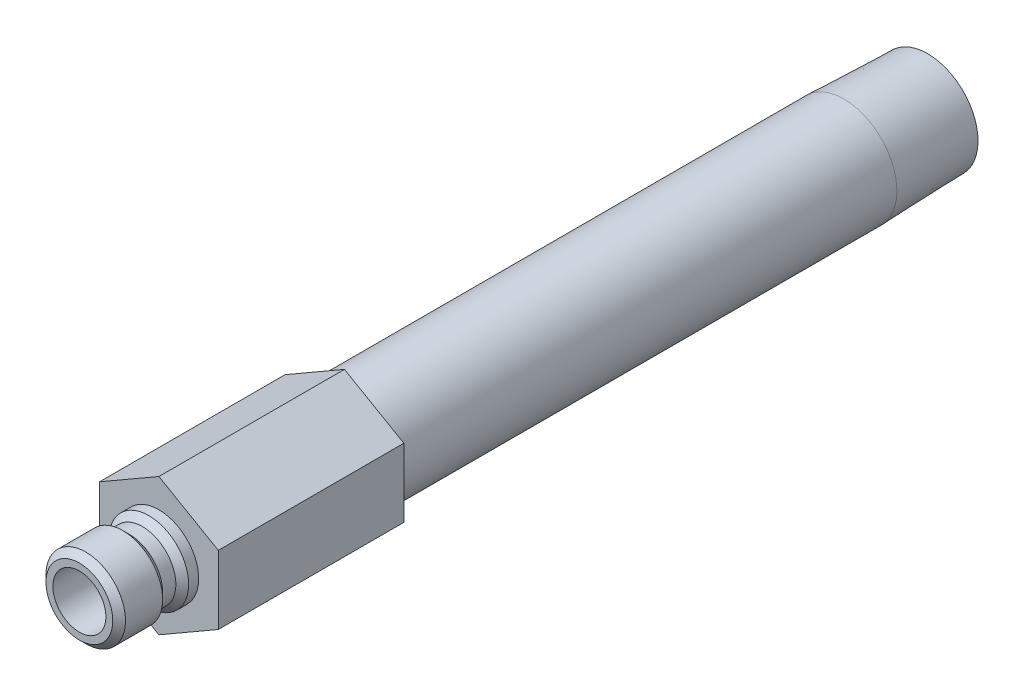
ISO-10303-21;
HEADER;
FILE_DESCRIPTION(('STEP AP214'),'2;1');
FILE_NAME('part.step','',(''),(''),'','','');
FILE_SCHEMA(('AUTOMOTIVE_DESIGN { 1 0 10303 214 1 1 1 1 }'));
ENDSEC;
DATA;
#1=APPLICATION_CONTEXT('core data for automotive mechanical design processes');
#2=APPLICATION_PROTOCOL_DEFINITION('international standard','automotive_design',2000,#1);
#3=PRODUCT_CONTEXT('',#1,'mechanical');
#4=PRODUCT('Part','Part','',(#3));
#5=PRODUCT_RELATED_PRODUCT_CATEGORY('part','',(#4));
#6=PRODUCT_DEFINITION_FORMATION('','',#4);
#7=PRODUCT_DEFINITION_CONTEXT('part definition',#1,'design');
#8=PRODUCT_DEFINITION('design','',#6,#7);
#9=PRODUCT_DEFINITION_SHAPE('','',#8);
#10=(LENGTH_UNIT() NAMED_UNIT(*) SI_UNIT(.MILLI.,.METRE.));
#11=(NAMED_UNIT(*) PLANE_ANGLE_UNIT() SI_UNIT($,.RADIAN.));
#12=(NAMED_UNIT(*) SI_UNIT($,.STERADIAN.) SOLID_ANGLE_UNIT());
#13=UNCERTAINTY_MEASURE_WITH_UNIT(LENGTH_MEASURE(1.E-05),#10,'distance_accuracy_value','');
#14=(GEOMETRIC_REPRESENTATION_CONTEXT(3) GLOBAL_UNCERTAINTY_ASSIGNED_CONTEXT((#13)) GLOBAL_UNIT_ASSIGNED_CONTEXT((#10,
#11,#12)) REPRESENTATION_CONTEXT('',''));
#15=CARTESIAN_POINT('',(0.,0.,0.));
#16=DIRECTION('',(0.,0.,1.));
#17=DIRECTION('',(1.,0.,0.));
#18=AXIS2_PLACEMENT_3D('',#15,#16,#17);
#19=CARTESIAN_POINT('',(0.,0.,0.));
#20=DIRECTION('',(0.,0.,-1.));
#21=DIRECTION('',(0.,1.,0.));
#22=AXIS2_PLACEMENT_3D('',#19,#20,#21);
#23=CYLINDRICAL_SURFACE('',#22,6.34999999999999);
#24=CARTESIAN_POINT('',(0.,0.,-82.042));
#25=DIRECTION('',(0.,0.,-1.));
#26=DIRECTION('',(0.,1.,0.));
#27=AXIS2_PLACEMENT_3D('',#24,#25,#26);
#28=CIRCLE('',#27,6.34999999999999);
#29=CARTESIAN_POINT('',(0.,6.35,-82.042));
#30=VERTEX_POINT('',#29);
#31=EDGE_CURVE('E42',#30,#30,#28,.T.);
#32=ORIENTED_EDGE('',*,*,#31,.F.);
#33=EDGE_LOOP('',(#32));
#34=FACE_BOUND('',#33,.T.);
#35=CARTESIAN_POINT('',(0.,0.,-22.225));
#36=DIRECTION('',(0.,0.,1.));
#37=DIRECTION('',(1.,0.,0.));
#38=AXIS2_PLACEMENT_3D('',#35,#36,#37);
#39=CIRCLE('',#38,6.34999999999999);
#40=CARTESIAN_POINT('',(6.34999999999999,0.,-22.225));
#41=VERTEX_POINT('',#40);
#42=EDGE_CURVE('E138',#41,#41,#39,.F.);
#43=ORIENTED_EDGE('',*,*,#42,.T.);
#44=EDGE_LOOP('',(#43));
#45=FACE_BOUND('',#44,.T.);
#46=ADVANCED_FACE('F33',(#34,#45),#23,.T.);
#47=CARTESIAN_POINT('',(0.,6.03647060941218,-92.075));
#48=DIRECTION('',(0.,0.,-1.));
#49=DIRECTION('',(0.,1.,0.));
#50=AXIS2_PLACEMENT_3D('',#47,#48,#49);
#51=PLANE('',#50);
#52=CARTESIAN_POINT('',(0.,0.,-92.075));
#53=DIRECTION('',(0.,0.,-1.));
#54=DIRECTION('',(0.,1.,0.));
#55=AXIS2_PLACEMENT_3D('',#52,#53,#54);
#56=CIRCLE('',#55,6.03647060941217);
#57=CARTESIAN_POINT('',(0.,6.03647060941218,-92.075));
#58=VERTEX_POINT('',#57);
#59=EDGE_CURVE('E11',#58,#58,#56,.T.);
#60=ORIENTED_EDGE('',*,*,#59,.T.);
#61=EDGE_LOOP('',(#60));
#62=FACE_BOUND('',#61,.T.);
#63=CARTESIAN_POINT('',(0.,0.,-92.075));
#64=DIRECTION('',(0.,0.,-1.));
#65=DIRECTION('',(0.,1.,0.));
#66=AXIS2_PLACEMENT_3D('',#63,#64,#65);
#67=CIRCLE('',#66,4.62279999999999);
#68=CARTESIAN_POINT('',(0.,4.6228,-92.075));
#69=VERTEX_POINT('',#68);
#70=EDGE_CURVE('E146',#69,#69,#67,.T.);
#71=ORIENTED_EDGE('',*,*,#70,.F.);
#72=EDGE_LOOP('',(#71));
#73=FACE_BOUND('',#72,.T.);
#74=ADVANCED_FACE('F35',(#62,#73),#51,.T.);
#75=CARTESIAN_POINT('',(0.,0.,-92.075));
#76=DIRECTION('',(0.,0.,1.));
#77=DIRECTION('',(0.,-1.,0.));
#78=AXIS2_PLACEMENT_3D('',#75,#76,#77);
#79=CONICAL_SURFACE('',#78,6.03647060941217,0.0312396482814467);
#80=ORIENTED_EDGE('',*,*,#31,.T.);
#81=EDGE_LOOP('',(#80));
#82=FACE_BOUND('',#81,.T.);
#83=ORIENTED_EDGE('',*,*,#59,.F.);
#84=EDGE_LOOP('',(#83));
#85=FACE_BOUND('',#84,.T.);
#86=ADVANCED_FACE('F181',(#82,#85),#79,.T.);
#87=CARTESIAN_POINT('',(0.,4.7625,0.));
#88=DIRECTION('',(0.,0.,1.));
#89=DIRECTION('',(0.,-1.,0.));
#90=AXIS2_PLACEMENT_3D('',#87,#88,#89);
#91=PLANE('',#90);
#92=CARTESIAN_POINT('',(0.,0.,0.));
#93=DIRECTION('',(0.,0.,-1.));
#94=DIRECTION('',(0.,1.,0.));
#95=AXIS2_PLACEMENT_3D('',#92,#93,#94);
#96=CIRCLE('',#95,4.7625);
#97=CARTESIAN_POINT('',(0.,4.7625,0.));
#98=VERTEX_POINT('',#97);
#99=EDGE_CURVE('E176',#98,#98,#96,.T.);
#100=ORIENTED_EDGE('',*,*,#99,.T.);
#101=EDGE_LOOP('',(#100));
#102=FACE_BOUND('',#101,.T.);
#103=DIRECTION('',(-0.866025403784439,-0.5,0.));
#104=VECTOR('',#103,1.);
#105=CARTESIAN_POINT('',(0.,8.21223022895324,0.));
#106=LINE('',#105,#104);
#107=CARTESIAN_POINT('',(0.,8.21223022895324,0.));
#108=VERTEX_POINT('',#107);
#109=CARTESIAN_POINT('',(-7.112,4.10611511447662,0.));
#110=VERTEX_POINT('',#109);
#111=EDGE_CURVE('E121',#108,#110,#106,.T.);
#112=ORIENTED_EDGE('',*,*,#111,.T.);
#113=DIRECTION('',(0.,-1.,0.));
#114=VECTOR('',#113,1.);
#115=CARTESIAN_POINT('',(-7.112,4.10611511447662,0.));
#116=LINE('',#115,#114);
#117=CARTESIAN_POINT('',(-7.112,-4.10611511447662,0.));
#118=VERTEX_POINT('',#117);
#119=EDGE_CURVE('E124',#110,#118,#116,.T.);
#120=ORIENTED_EDGE('',*,*,#119,.T.);
#121=DIRECTION('',(0.866025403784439,-0.5,0.));
#122=VECTOR('',#121,1.);
#123=CARTESIAN_POINT('',(-7.112,-4.10611511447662,0.));
#124=LINE('',#123,#122);
#125=CARTESIAN_POINT('',(0.,-8.21223022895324,0.));
#126=VERTEX_POINT('',#125);
#127=EDGE_CURVE('E127',#118,#126,#124,.T.);
#128=ORIENTED_EDGE('',*,*,#127,.T.);
#129=DIRECTION('',(0.866025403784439,0.5,0.));
#130=VECTOR('',#129,1.);
#131=CARTESIAN_POINT('',(0.,-8.21223022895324,0.));
#132=LINE('',#131,#130);
#133=CARTESIAN_POINT('',(7.112,-4.10611511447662,0.));
#134=VERTEX_POINT('',#133);
#135=EDGE_CURVE('E130',#126,#134,#132,.T.);
#136=ORIENTED_EDGE('',*,*,#135,.T.);
#137=DIRECTION('',(0.,1.,0.));
#138=VECTOR('',#137,1.);
#139=CARTESIAN_POINT('',(7.112,-4.10611511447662,0.));
#140=LINE('',#139,#138);
#141=CARTESIAN_POINT('',(7.112,4.10611511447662,0.));
#142=VERTEX_POINT('',#141);
#143=EDGE_CURVE('E98',#134,#142,#140,.T.);
#144=ORIENTED_EDGE('',*,*,#143,.T.);
#145=DIRECTION('',(-0.866025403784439,0.5,0.));
#146=VECTOR('',#145,1.);
#147=CARTESIAN_POINT('',(7.112,4.10611511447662,0.));
#148=LINE('',#147,#146);
#149=EDGE_CURVE('E133',#142,#108,#148,.T.);
#150=ORIENTED_EDGE('',*,*,#149,.T.);
#151=EDGE_LOOP('',(#112,#120,#128,#136,#144,#150));
#152=FACE_BOUND('',#151,.T.);
#153=ADVANCED_FACE('F250',(#102,#152),#91,.T.);
#154=CARTESIAN_POINT('',(0.,0.,0.));
#155=DIRECTION('',(0.,0.,-1.));
#156=DIRECTION('',(0.,1.,0.));
#157=AXIS2_PLACEMENT_3D('',#154,#155,#156);
#158=CYLINDRICAL_SURFACE('',#157,4.7625);
#159=CARTESIAN_POINT('',(0.,0.,1.2065));
#160=DIRECTION('',(0.,0.,-1.));
#161=DIRECTION('',(0.,1.,0.));
#162=AXIS2_PLACEMENT_3D('',#159,#160,#161);
#163=CIRCLE('',#162,4.7625);
#164=CARTESIAN_POINT('',(0.,4.7625,1.2065));
#165=VERTEX_POINT('',#164);
#166=EDGE_CURVE('E173',#165,#165,#163,.T.);
#167=ORIENTED_EDGE('',*,*,#166,.T.);
#168=EDGE_LOOP('',(#167));
#169=FACE_BOUND('',#168,.T.);
#170=ORIENTED_EDGE('',*,*,#99,.F.);
#171=EDGE_LOOP('',(#170));
#172=FACE_BOUND('',#171,.T.);
#173=ADVANCED_FACE('F246',(#169,#172),#158,.T.);
#174=CARTESIAN_POINT('',(0.,0.,1.2065));
#175=DIRECTION('',(0.,0.,-1.));
#176=DIRECTION('',(0.,1.,0.));
#177=AXIS2_PLACEMENT_3D('',#174,#175,#176);
#178=CONICAL_SURFACE('',#177,4.7625,0.785398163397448);
#179=CARTESIAN_POINT('',(0.,0.,1.9685));
#180=DIRECTION('',(0.,0.,-1.));
#181=DIRECTION('',(0.,1.,0.));
#182=AXIS2_PLACEMENT_3D('',#179,#180,#181);
#183=CIRCLE('',#182,4.0005);
#184=CARTESIAN_POINT('',(0.,4.0005,1.9685));
#185=VERTEX_POINT('',#184);
#186=EDGE_CURVE('E170',#185,#185,#183,.T.);
#187=ORIENTED_EDGE('',*,*,#186,.T.);
#188=EDGE_LOOP('',(#187));
#189=FACE_BOUND('',#188,.T.);
#190=ORIENTED_EDGE('',*,*,#166,.F.);
#191=EDGE_LOOP('',(#190));
#192=FACE_BOUND('',#191,.T.);
#193=ADVANCED_FACE('F242',(#189,#192),#178,.T.);
#194=CARTESIAN_POINT('',(0.,0.,0.));
#195=DIRECTION('',(0.,0.,-1.));
#196=DIRECTION('',(0.,1.,0.));
#197=AXIS2_PLACEMENT_3D('',#194,#195,#196);
#198=CYLINDRICAL_SURFACE('',#197,4.0005);
#199=CARTESIAN_POINT('',(0.,0.,3.556));
#200=DIRECTION('',(0.,0.,-1.));
#201=DIRECTION('',(0.,1.,0.));
#202=AXIS2_PLACEMENT_3D('',#199,#200,#201);
#203=CIRCLE('',#202,4.0005);
#204=CARTESIAN_POINT('',(0.,4.0005,3.556));
#205=VERTEX_POINT('',#204);
#206=EDGE_CURVE('E167',#205,#205,#203,.T.);
#207=ORIENTED_EDGE('',*,*,#206,.T.);
#208=EDGE_LOOP('',(#207));
#209=FACE_BOUND('',#208,.T.);
#210=ORIENTED_EDGE('',*,*,#186,.F.);
#211=EDGE_LOOP('',(#210));
#212=FACE_BOUND('',#211,.T.);
#213=ADVANCED_FACE('F238',(#209,#212),#198,.T.);
#214=CARTESIAN_POINT('',(0.,0.,3.556));
#215=DIRECTION('',(0.,0.,1.));
#216=DIRECTION('',(0.,-1.,0.));
#217=AXIS2_PLACEMENT_3D('',#214,#215,#216);
#218=CONICAL_SURFACE('',#217,4.0005,0.785398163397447);
#219=CARTESIAN_POINT('',(0.,0.,4.318));
#220=DIRECTION('',(0.,0.,-1.));
#221=DIRECTION('',(0.,1.,0.));
#222=AXIS2_PLACEMENT_3D('',#219,#220,#221);
#223=CIRCLE('',#222,4.7625);
#224=CARTESIAN_POINT('',(0.,4.7625,4.318));
#225=VERTEX_POINT('',#224);
#226=EDGE_CURVE('E164',#225,#225,#223,.T.);
#227=ORIENTED_EDGE('',*,*,#226,.T.);
#228=EDGE_LOOP('',(#227));
#229=FACE_BOUND('',#228,.T.);
#230=ORIENTED_EDGE('',*,*,#206,.F.);
#231=EDGE_LOOP('',(#230));
#232=FACE_BOUND('',#231,.T.);
#233=ADVANCED_FACE('F234',(#229,#232),#218,.T.);
#234=CARTESIAN_POINT('',(0.,0.,0.));
#235=DIRECTION('',(0.,0.,-1.));
#236=DIRECTION('',(0.,1.,0.));
#237=AXIS2_PLACEMENT_3D('',#234,#235,#236);
#238=CYLINDRICAL_SURFACE('',#237,4.7625);
#239=CARTESIAN_POINT('',(0.,0.,8.763));
#240=DIRECTION('',(0.,0.,-1.));
#241=DIRECTION('',(0.,1.,0.));
#242=AXIS2_PLACEMENT_3D('',#239,#240,#241);
#243=CIRCLE('',#242,4.7625);
#244=CARTESIAN_POINT('',(0.,4.7625,8.763));
#245=VERTEX_POINT('',#244);
#246=EDGE_CURVE('E161',#245,#245,#243,.T.);
#247=ORIENTED_EDGE('',*,*,#246,.T.);
#248=EDGE_LOOP('',(#247));
#249=FACE_BOUND('',#248,.T.);
#250=ORIENTED_EDGE('',*,*,#226,.F.);
#251=EDGE_LOOP('',(#250));
#252=FACE_BOUND('',#251,.T.);
#253=ADVANCED_FACE('F230',(#249,#252),#238,.T.);
#254=CARTESIAN_POINT('',(0.,0.,8.763));
#255=DIRECTION('',(0.,0.,-1.));
#256=DIRECTION('',(0.,1.,0.));
#257=AXIS2_PLACEMENT_3D('',#254,#255,#256);
#258=CONICAL_SURFACE('',#257,4.7625,0.785398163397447);
#259=CARTESIAN_POINT('',(0.,0.,9.525));
#260=DIRECTION('',(0.,0.,-1.));
#261=DIRECTION('',(0.,1.,0.));
#262=AXIS2_PLACEMENT_3D('',#259,#260,#261);
#263=CIRCLE('',#262,4.0005);
#264=CARTESIAN_POINT('',(0.,4.0005,9.525));
#265=VERTEX_POINT('',#264);
#266=EDGE_CURVE('E158',#265,#265,#263,.T.);
#267=ORIENTED_EDGE('',*,*,#266,.T.);
#268=EDGE_LOOP('',(#267));
#269=FACE_BOUND('',#268,.T.);
#270=ORIENTED_EDGE('',*,*,#246,.F.);
#271=EDGE_LOOP('',(#270));
#272=FACE_BOUND('',#271,.T.);
#273=ADVANCED_FACE('F226',(#269,#272),#258,.T.);
#274=CARTESIAN_POINT('',(0.,3.175,9.525));
#275=DIRECTION('',(0.,0.,1.));
#276=DIRECTION('',(0.,-1.,0.));
#277=AXIS2_PLACEMENT_3D('',#274,#275,#276);
#278=PLANE('',#277);
#279=CARTESIAN_POINT('',(0.,0.,9.525));
#280=DIRECTION('',(0.,0.,-1.));
#281=DIRECTION('',(0.,1.,0.));
#282=AXIS2_PLACEMENT_3D('',#279,#280,#281);
#283=CIRCLE('',#282,3.175);
#284=CARTESIAN_POINT('',(0.,3.175,9.525));
#285=VERTEX_POINT('',#284);
#286=EDGE_CURVE('E155',#285,#285,#283,.T.);
#287=ORIENTED_EDGE('',*,*,#286,.T.);
#288=EDGE_LOOP('',(#287));
#289=FACE_BOUND('',#288,.T.);
#290=ORIENTED_EDGE('',*,*,#266,.F.);
#291=EDGE_LOOP('',(#290));
#292=FACE_BOUND('',#291,.T.);
#293=ADVANCED_FACE('F222',(#289,#292),#278,.T.);
#294=CARTESIAN_POINT('',(0.,0.,0.));
#295=DIRECTION('',(0.,0.,-1.));
#296=DIRECTION('',(0.,1.,0.));
#297=AXIS2_PLACEMENT_3D('',#294,#295,#296);
#298=CYLINDRICAL_SURFACE('',#297,3.175);
#299=ORIENTED_EDGE('',*,*,#286,.F.);
#300=EDGE_LOOP('',(#299));
#301=FACE_BOUND('',#300,.T.);
#302=CARTESIAN_POINT('',(0.,0.,-22.225));
#303=DIRECTION('',(0.,0.,-1.));
#304=DIRECTION('',(0.,1.,0.));
#305=AXIS2_PLACEMENT_3D('',#302,#303,#304);
#306=CIRCLE('',#305,3.175);
#307=CARTESIAN_POINT('',(0.,3.175,-22.225));
#308=VERTEX_POINT('',#307);
#309=EDGE_CURVE('E152',#308,#308,#306,.T.);
#310=ORIENTED_EDGE('',*,*,#309,.T.);
#311=EDGE_LOOP('',(#310));
#312=FACE_BOUND('',#311,.T.);
#313=ADVANCED_FACE('F218',(#301,#312),#298,.F.);
#314=CARTESIAN_POINT('',(0.,4.6228,-22.225));
#315=DIRECTION('',(0.,0.,-1.));
#316=DIRECTION('',(0.,1.,0.));
#317=AXIS2_PLACEMENT_3D('',#314,#315,#316);
#318=PLANE('',#317);
#319=CARTESIAN_POINT('',(0.,0.,-22.225));
#320=DIRECTION('',(0.,0.,-1.));
#321=DIRECTION('',(0.,1.,0.));
#322=AXIS2_PLACEMENT_3D('',#319,#320,#321);
#323=CIRCLE('',#322,4.6228);
#324=CARTESIAN_POINT('',(0.,4.6228,-22.225));
#325=VERTEX_POINT('',#324);
#326=EDGE_CURVE('E149',#325,#325,#323,.T.);
#327=ORIENTED_EDGE('',*,*,#326,.T.);
#328=EDGE_LOOP('',(#327));
#329=FACE_BOUND('',#328,.T.);
#330=ORIENTED_EDGE('',*,*,#309,.F.);
#331=EDGE_LOOP('',(#330));
#332=FACE_BOUND('',#331,.T.);
#333=ADVANCED_FACE('F199',(#329,#332),#318,.T.);
#334=CARTESIAN_POINT('',(0.,0.,0.));
#335=DIRECTION('',(0.,0.,-1.));
#336=DIRECTION('',(0.,1.,0.));
#337=AXIS2_PLACEMENT_3D('',#334,#335,#336);
#338=CYLINDRICAL_SURFACE('',#337,4.62279999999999);
#339=ORIENTED_EDGE('',*,*,#70,.T.);
#340=EDGE_LOOP('',(#339));
#341=FACE_BOUND('',#340,.T.);
#342=ORIENTED_EDGE('',*,*,#326,.F.);
#343=EDGE_LOOP('',(#342));
#344=FACE_BOUND('',#343,.T.);
#345=ADVANCED_FACE('F191',(#341,#344),#338,.F.);
#346=CARTESIAN_POINT('',(-7.112,4.10611511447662,-22.225));
#347=DIRECTION('',(0.,0.,1.));
#348=DIRECTION('',(1.,0.,0.));
#349=AXIS2_PLACEMENT_3D('',#346,#347,#348);
#350=PLANE('',#349);
#351=ORIENTED_EDGE('',*,*,#42,.F.);
#352=EDGE_LOOP('',(#351));
#353=FACE_BOUND('',#352,.T.);
#354=DIRECTION('',(-0.866025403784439,-0.5,0.));
#355=VECTOR('',#354,1.);
#356=CARTESIAN_POINT('',(0.,8.21223022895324,-22.225));
#357=LINE('',#356,#355);
#358=CARTESIAN_POINT('',(0.,8.21223022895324,-22.225));
#359=VERTEX_POINT('',#358);
#360=CARTESIAN_POINT('',(-7.112,4.10611511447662,-22.225));
#361=VERTEX_POINT('',#360);
#362=EDGE_CURVE('E136',#359,#361,#357,.T.);
#363=ORIENTED_EDGE('',*,*,#362,.F.);
#364=DIRECTION('',(-0.866025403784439,0.5,0.));
#365=VECTOR('',#364,1.);
#366=CARTESIAN_POINT('',(7.112,4.10611511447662,-22.225));
#367=LINE('',#366,#365);
#368=CARTESIAN_POINT('',(7.112,4.10611511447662,-22.225));
#369=VERTEX_POINT('',#368);
#370=EDGE_CURVE('E111',#369,#359,#367,.T.);
#371=ORIENTED_EDGE('',*,*,#370,.F.);
#372=DIRECTION('',(0.,1.,0.));
#373=VECTOR('',#372,1.);
#374=CARTESIAN_POINT('',(7.112,-4.10611511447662,-22.225));
#375=LINE('',#374,#373);
#376=CARTESIAN_POINT('',(7.112,-4.10611511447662,-22.225));
#377=VERTEX_POINT('',#376);
#378=EDGE_CURVE('E96',#377,#369,#375,.T.);
#379=ORIENTED_EDGE('',*,*,#378,.F.);
#380=DIRECTION('',(0.866025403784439,0.5,0.));
#381=VECTOR('',#380,1.);
#382=CARTESIAN_POINT('',(0.,-8.21223022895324,-22.225));
#383=LINE('',#382,#381);
#384=CARTESIAN_POINT('',(0.,-8.21223022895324,-22.225));
#385=VERTEX_POINT('',#384);
#386=EDGE_CURVE('E109',#385,#377,#383,.T.);
#387=ORIENTED_EDGE('',*,*,#386,.F.);
#388=DIRECTION('',(0.866025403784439,-0.5,0.));
#389=VECTOR('',#388,1.);
#390=CARTESIAN_POINT('',(-7.112,-4.10611511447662,-22.225));
#391=LINE('',#390,#389);
#392=CARTESIAN_POINT('',(-7.112,-4.10611511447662,-22.225));
#393=VERTEX_POINT('',#392);
#394=EDGE_CURVE('E114',#393,#385,#391,.T.);
#395=ORIENTED_EDGE('',*,*,#394,.F.);
#396=DIRECTION('',(0.,-1.,0.));
#397=VECTOR('',#396,1.);
#398=CARTESIAN_POINT('',(-7.112,4.10611511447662,-22.225));
#399=LINE('',#398,#397);
#400=EDGE_CURVE('E116',#361,#393,#399,.T.);
#401=ORIENTED_EDGE('',*,*,#400,.F.);
#402=EDGE_LOOP('',(#363,#371,#379,#387,#395,#401));
#403=FACE_BOUND('',#402,.T.);
#404=ADVANCED_FACE('F107',(#353,#403),#350,.F.);
#405=CARTESIAN_POINT('',(0.,8.21223022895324,-22.225));
#406=DIRECTION('',(-0.5,0.866025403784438,0.));
#407=DIRECTION('',(-0.866025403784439,-0.5,0.));
#408=AXIS2_PLACEMENT_3D('',#405,#406,#407);
#409=PLANE('',#408);
#410=ORIENTED_EDGE('',*,*,#111,.F.);
#411=DIRECTION('',(0.,0.,1.));
#412=VECTOR('',#411,1.);
#413=CARTESIAN_POINT('',(0.,8.21223022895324,-22.225));
#414=LINE('',#413,#412);
#415=EDGE_CURVE('E50',#359,#108,#414,.T.);
#416=ORIENTED_EDGE('',*,*,#415,.F.);
#417=ORIENTED_EDGE('',*,*,#362,.T.);
#418=DIRECTION('',(0.,0.,1.));
#419=VECTOR('',#418,1.);
#420=CARTESIAN_POINT('',(-7.112,4.10611511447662,-22.225));
#421=LINE('',#420,#419);
#422=EDGE_CURVE('E85',#361,#110,#421,.T.);
#423=ORIENTED_EDGE('',*,*,#422,.T.);
#424=EDGE_LOOP('',(#410,#416,#417,#423));
#425=FACE_BOUND('',#424,.T.);
#426=ADVANCED_FACE('F190',(#425),#409,.T.);
#427=CARTESIAN_POINT('',(7.112,4.10611511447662,-22.225));
#428=DIRECTION('',(0.5,0.866025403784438,0.));
#429=DIRECTION('',(-0.866025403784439,0.5,0.));
#430=AXIS2_PLACEMENT_3D('',#427,#428,#429);
#431=PLANE('',#430);
#432=ORIENTED_EDGE('',*,*,#149,.F.);
#433=DIRECTION('',(0.,0.,1.));
#434=VECTOR('',#433,1.);
#435=CARTESIAN_POINT('',(7.112,4.10611511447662,-22.225));
#436=LINE('',#435,#434);
#437=EDGE_CURVE('E73',#369,#142,#436,.T.);
#438=ORIENTED_EDGE('',*,*,#437,.F.);
#439=ORIENTED_EDGE('',*,*,#370,.T.);
#440=ORIENTED_EDGE('',*,*,#415,.T.);
#441=EDGE_LOOP('',(#432,#438,#439,#440));
#442=FACE_BOUND('',#441,.T.);
#443=ADVANCED_FACE('F197',(#442),#431,.T.);
#444=CARTESIAN_POINT('',(7.112,-4.10611511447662,-22.225));
#445=DIRECTION('',(1.,0.,0.));
#446=DIRECTION('',(0.,1.,0.));
#447=AXIS2_PLACEMENT_3D('',#444,#445,#446);
#448=PLANE('',#447);
#449=ORIENTED_EDGE('',*,*,#143,.F.);
#450=DIRECTION('',(0.,0.,1.));
#451=VECTOR('',#450,1.);
#452=CARTESIAN_POINT('',(7.112,-4.10611511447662,-22.225));
#453=LINE('',#452,#451);
#454=EDGE_CURVE('E93',#377,#134,#453,.T.);
#455=ORIENTED_EDGE('',*,*,#454,.F.);
#456=ORIENTED_EDGE('',*,*,#378,.T.);
#457=ORIENTED_EDGE('',*,*,#437,.T.);
#458=EDGE_LOOP('',(#449,#455,#456,#457));
#459=FACE_BOUND('',#458,.T.);
#460=ADVANCED_FACE('F95',(#459),#448,.T.);
#461=CARTESIAN_POINT('',(0.,-8.21223022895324,-22.225));
#462=DIRECTION('',(0.5,-0.866025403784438,0.));
#463=DIRECTION('',(0.866025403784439,0.5,0.));
#464=AXIS2_PLACEMENT_3D('',#461,#462,#463);
#465=PLANE('',#464);
#466=ORIENTED_EDGE('',*,*,#135,.F.);
#467=DIRECTION('',(0.,0.,1.));
#468=VECTOR('',#467,1.);
#469=CARTESIAN_POINT('',(0.,-8.21223022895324,-22.225));
#470=LINE('',#469,#468);
#471=EDGE_CURVE('E103',#385,#126,#470,.T.);
#472=ORIENTED_EDGE('',*,*,#471,.F.);
#473=ORIENTED_EDGE('',*,*,#386,.T.);
#474=ORIENTED_EDGE('',*,*,#454,.T.);
#475=EDGE_LOOP('',(#466,#472,#473,#474));
#476=FACE_BOUND('',#475,.T.);
#477=ADVANCED_FACE('F113',(#476),#465,.T.);
#478=CARTESIAN_POINT('',(-7.112,-4.10611511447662,-22.225));
#479=DIRECTION('',(-0.5,-0.866025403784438,0.));
#480=DIRECTION('',(0.866025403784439,-0.5,0.));
#481=AXIS2_PLACEMENT_3D('',#478,#479,#480);
#482=PLANE('',#481);
#483=ORIENTED_EDGE('',*,*,#127,.F.);
#484=DIRECTION('',(0.,0.,1.));
#485=VECTOR('',#484,1.);
#486=CARTESIAN_POINT('',(-7.112,-4.10611511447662,-22.225));
#487=LINE('',#486,#485);
#488=EDGE_CURVE('E141',#393,#118,#487,.T.);
#489=ORIENTED_EDGE('',*,*,#488,.F.);
#490=ORIENTED_EDGE('',*,*,#394,.T.);
#491=ORIENTED_EDGE('',*,*,#471,.T.);
#492=EDGE_LOOP('',(#483,#489,#490,#491));
#493=FACE_BOUND('',#492,.T.);
#494=ADVANCED_FACE('F209',(#493),#482,.T.);
#495=CARTESIAN_POINT('',(-7.112,4.10611511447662,-22.225));
#496=DIRECTION('',(-1.,0.,0.));
#497=DIRECTION('',(0.,0.,1.));
#498=AXIS2_PLACEMENT_3D('',#495,#496,#497);
#499=PLANE('',#498);
#500=ORIENTED_EDGE('',*,*,#119,.F.);
#501=ORIENTED_EDGE('',*,*,#422,.F.);
#502=ORIENTED_EDGE('',*,*,#400,.T.);
#503=ORIENTED_EDGE('',*,*,#488,.T.);
#504=EDGE_LOOP('',(#500,#501,#502,#503));
#505=FACE_BOUND('',#504,.T.);
#506=ADVANCED_FACE('F212',(#505),#499,.T.);
#507=CLOSED_SHELL('',(#46,#74,#86,#153,#173,#193,#213,#233,#253,#273,#293,#313,#333,#345,#404,
#426,#443,#460,#477,#494,#506));
#508=MANIFOLD_SOLID_BREP('B2',#507);
#509=ADVANCED_BREP_SHAPE_REPRESENTATION('',(#18,#508),#14);
#510=SHAPE_DEFINITION_REPRESENTATION(#9,#509);
ENDSEC;
END-ISO-10303-21;
